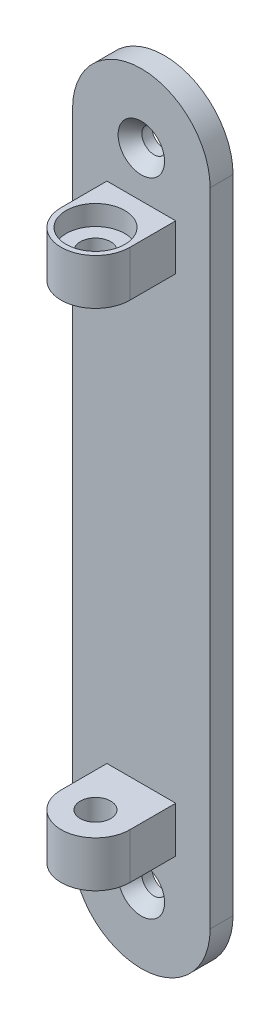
ISO-10303-21;
HEADER;
FILE_DESCRIPTION(('STEP AP214'),'2;1');
FILE_NAME('part.step','',(''),(''),'','','');
FILE_SCHEMA(('AUTOMOTIVE_DESIGN { 1 0 10303 214 1 1 1 1 }'));
ENDSEC;
DATA;
#1=APPLICATION_CONTEXT('core data for automotive mechanical design processes');
#2=APPLICATION_PROTOCOL_DEFINITION('international standard','automotive_design',2000,#1);
#3=PRODUCT_CONTEXT('',#1,'mechanical');
#4=PRODUCT('Part','Part','',(#3));
#5=PRODUCT_RELATED_PRODUCT_CATEGORY('part','',(#4));
#6=PRODUCT_DEFINITION_FORMATION('','',#4);
#7=PRODUCT_DEFINITION_CONTEXT('part definition',#1,'design');
#8=PRODUCT_DEFINITION('design','',#6,#7);
#9=PRODUCT_DEFINITION_SHAPE('','',#8);
#10=(LENGTH_UNIT() NAMED_UNIT(*) SI_UNIT(.MILLI.,.METRE.));
#11=(NAMED_UNIT(*) PLANE_ANGLE_UNIT() SI_UNIT($,.RADIAN.));
#12=(NAMED_UNIT(*) SI_UNIT($,.STERADIAN.) SOLID_ANGLE_UNIT());
#13=UNCERTAINTY_MEASURE_WITH_UNIT(LENGTH_MEASURE(1.E-05),#10,'distance_accuracy_value','');
#14=(GEOMETRIC_REPRESENTATION_CONTEXT(3) GLOBAL_UNCERTAINTY_ASSIGNED_CONTEXT((#13)) GLOBAL_UNIT_ASSIGNED_CONTEXT((#10,
#11,#12)) REPRESENTATION_CONTEXT('',''));
#15=CARTESIAN_POINT('',(0.,0.,0.));
#16=DIRECTION('',(0.,0.,1.));
#17=DIRECTION('',(1.,0.,0.));
#18=AXIS2_PLACEMENT_3D('',#15,#16,#17);
#19=CARTESIAN_POINT('',(9.52500000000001,63.5,19.05));
#20=DIRECTION('',(0.,1.,0.));
#21=DIRECTION('',(0.,0.,1.));
#22=AXIS2_PLACEMENT_3D('',#19,#20,#21);
#23=PLANE('',#22);
#24=DIRECTION('',(1.,0.,0.));
#25=VECTOR('',#24,1.);
#26=CARTESIAN_POINT('',(9.52500000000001,63.5,6.35));
#27=LINE('',#26,#25);
#28=CARTESIAN_POINT('',(9.525,63.5,6.35));
#29=VERTEX_POINT('',#28);
#30=CARTESIAN_POINT('',(28.575,63.5,6.35));
#31=VERTEX_POINT('',#30);
#32=EDGE_CURVE('E41',#29,#31,#27,.T.);
#33=ORIENTED_EDGE('',*,*,#32,.T.);
#34=DIRECTION('',(0.,0.,-1.));
#35=VECTOR('',#34,1.);
#36=CARTESIAN_POINT('',(28.575,63.5,19.05));
#37=LINE('',#36,#35);
#38=CARTESIAN_POINT('',(28.575,63.5,19.05));
#39=VERTEX_POINT('',#38);
#40=EDGE_CURVE('E217',#39,#31,#37,.T.);
#41=ORIENTED_EDGE('',*,*,#40,.F.);
#42=CARTESIAN_POINT('',(19.05,63.5,19.05));
#43=DIRECTION('',(0.,1.,0.));
#44=DIRECTION('',(0.,0.,1.));
#45=AXIS2_PLACEMENT_3D('',#42,#43,#44);
#46=CIRCLE('',#45,9.52499999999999);
#47=CARTESIAN_POINT('',(9.52500000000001,63.5,19.05));
#48=VERTEX_POINT('',#47);
#49=EDGE_CURVE('E192',#39,#48,#46,.F.);
#50=ORIENTED_EDGE('',*,*,#49,.T.);
#51=DIRECTION('',(0.,0.,-1.));
#52=VECTOR('',#51,1.);
#53=CARTESIAN_POINT('',(9.52500000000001,63.5,19.05));
#54=LINE('',#53,#52);
#55=EDGE_CURVE('E220',#48,#29,#54,.T.);
#56=ORIENTED_EDGE('',*,*,#55,.T.);
#57=EDGE_LOOP('',(#33,#41,#50,#56));
#58=FACE_BOUND('',#57,.T.);
#59=CARTESIAN_POINT('',(19.05,63.5,19.05));
#60=DIRECTION('',(0.,1.,0.));
#61=DIRECTION('',(0.,0.,1.));
#62=AXIS2_PLACEMENT_3D('',#59,#60,#61);
#63=CIRCLE('',#62,4.21639999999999);
#64=CARTESIAN_POINT('',(19.05,63.5,23.2664));
#65=VERTEX_POINT('',#64);
#66=EDGE_CURVE('E188',#65,#65,#63,.F.);
#67=ORIENTED_EDGE('',*,*,#66,.F.);
#68=EDGE_LOOP('',(#67));
#69=FACE_BOUND('',#68,.T.);
#70=ADVANCED_FACE('F26',(#58,#69),#23,.F.);
#71=CARTESIAN_POINT('',(19.05,88.9,6.35));
#72=DIRECTION('',(0.,0.,-1.));
#73=DIRECTION('',(-1.,0.,0.));
#74=AXIS2_PLACEMENT_3D('',#71,#72,#73);
#75=PLANE('',#74);
#76=DIRECTION('',(0.,-1.,0.));
#77=VECTOR('',#76,1.);
#78=CARTESIAN_POINT('',(0.,0.,6.35));
#79=LINE('',#78,#77);
#80=CARTESIAN_POINT('',(0.,88.9,6.35));
#81=VERTEX_POINT('',#80);
#82=CARTESIAN_POINT('',(0.,-88.9,6.35));
#83=VERTEX_POINT('',#82);
#84=EDGE_CURVE('E241',#81,#83,#79,.T.);
#85=ORIENTED_EDGE('',*,*,#84,.T.);
#86=CARTESIAN_POINT('',(19.05,-88.9,6.35));
#87=DIRECTION('',(0.,0.,-1.));
#88=DIRECTION('',(-1.,0.,0.));
#89=AXIS2_PLACEMENT_3D('',#86,#87,#88);
#90=CIRCLE('',#89,19.05);
#91=CARTESIAN_POINT('',(38.1,-88.9,6.35));
#92=VERTEX_POINT('',#91);
#93=EDGE_CURVE('E170',#92,#83,#90,.T.);
#94=ORIENTED_EDGE('',*,*,#93,.F.);
#95=DIRECTION('',(0.,1.,0.));
#96=VECTOR('',#95,1.);
#97=CARTESIAN_POINT('',(38.1,88.9,6.35));
#98=LINE('',#97,#96);
#99=CARTESIAN_POINT('',(38.1,88.9,6.35));
#100=VERTEX_POINT('',#99);
#101=EDGE_CURVE('E237',#92,#100,#98,.T.);
#102=ORIENTED_EDGE('',*,*,#101,.T.);
#103=CARTESIAN_POINT('',(19.05,88.9,6.35));
#104=DIRECTION('',(0.,0.,1.));
#105=DIRECTION('',(-1.,0.,0.));
#106=AXIS2_PLACEMENT_3D('',#103,#104,#105);
#107=CIRCLE('',#106,19.05);
#108=EDGE_CURVE('E239',#100,#81,#107,.T.);
#109=ORIENTED_EDGE('',*,*,#108,.T.);
#110=EDGE_LOOP('',(#85,#94,#102,#109));
#111=FACE_BOUND('',#110,.T.);
#112=CARTESIAN_POINT('',(19.05,88.9,6.35));
#113=DIRECTION('',(0.,0.,1.));
#114=DIRECTION('',(1.,0.,0.));
#115=AXIS2_PLACEMENT_3D('',#112,#113,#114);
#116=CIRCLE('',#115,6.4389);
#117=CARTESIAN_POINT('',(25.4889,88.9,6.35));
#118=VERTEX_POINT('',#117);
#119=EDGE_CURVE('E228',#118,#118,#116,.T.);
#120=ORIENTED_EDGE('',*,*,#119,.F.);
#121=EDGE_LOOP('',(#120));
#122=FACE_BOUND('',#121,.T.);
#123=DIRECTION('',(0.,-1.,0.));
#124=VECTOR('',#123,1.);
#125=CARTESIAN_POINT('',(9.52500000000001,76.2,6.35));
#126=LINE('',#125,#124);
#127=CARTESIAN_POINT('',(9.52500000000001,76.2,6.35));
#128=VERTEX_POINT('',#127);
#129=EDGE_CURVE('E195',#128,#29,#126,.T.);
#130=ORIENTED_EDGE('',*,*,#129,.F.);
#131=DIRECTION('',(-1.,0.,0.));
#132=VECTOR('',#131,1.);
#133=CARTESIAN_POINT('',(9.52500000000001,76.2,6.35));
#134=LINE('',#133,#132);
#135=CARTESIAN_POINT('',(28.575,76.2,6.35));
#136=VERTEX_POINT('',#135);
#137=EDGE_CURVE('E202',#136,#128,#134,.T.);
#138=ORIENTED_EDGE('',*,*,#137,.F.);
#139=DIRECTION('',(0.,1.,0.));
#140=VECTOR('',#139,1.);
#141=CARTESIAN_POINT('',(28.575,76.2,6.35));
#142=LINE('',#141,#140);
#143=EDGE_CURVE('E46',#31,#136,#142,.T.);
#144=ORIENTED_EDGE('',*,*,#143,.F.);
#145=ORIENTED_EDGE('',*,*,#32,.F.);
#146=EDGE_LOOP('',(#130,#138,#144,#145));
#147=FACE_BOUND('',#146,.T.);
#148=CARTESIAN_POINT('',(19.05,-88.9,6.35));
#149=DIRECTION('',(0.,0.,-1.));
#150=DIRECTION('',(1.,0.,0.));
#151=AXIS2_PLACEMENT_3D('',#148,#149,#150);
#152=CIRCLE('',#151,6.4389);
#153=CARTESIAN_POINT('',(25.4889,-88.9,6.35));
#154=VERTEX_POINT('',#153);
#155=EDGE_CURVE('E164',#154,#154,#152,.T.);
#156=ORIENTED_EDGE('',*,*,#155,.T.);
#157=EDGE_LOOP('',(#156));
#158=FACE_BOUND('',#157,.T.);
#159=DIRECTION('',(0.,1.,0.));
#160=VECTOR('',#159,1.);
#161=CARTESIAN_POINT('',(9.525,-76.2,6.35));
#162=LINE('',#161,#160);
#163=CARTESIAN_POINT('',(9.525,-76.2,6.35));
#164=VERTEX_POINT('',#163);
#165=CARTESIAN_POINT('',(9.525,-63.5,6.35));
#166=VERTEX_POINT('',#165);
#167=EDGE_CURVE('E140',#164,#166,#162,.T.);
#168=ORIENTED_EDGE('',*,*,#167,.T.);
#169=DIRECTION('',(1.,0.,0.));
#170=VECTOR('',#169,1.);
#171=CARTESIAN_POINT('',(9.525,-63.5,6.35));
#172=LINE('',#171,#170);
#173=CARTESIAN_POINT('',(28.575,-63.5,6.35));
#174=VERTEX_POINT('',#173);
#175=EDGE_CURVE('E142',#166,#174,#172,.T.);
#176=ORIENTED_EDGE('',*,*,#175,.T.);
#177=DIRECTION('',(0.,-1.,0.));
#178=VECTOR('',#177,1.);
#179=CARTESIAN_POINT('',(28.575,-76.2,6.35));
#180=LINE('',#179,#178);
#181=CARTESIAN_POINT('',(28.575,-76.2,6.35));
#182=VERTEX_POINT('',#181);
#183=EDGE_CURVE('E130',#174,#182,#180,.T.);
#184=ORIENTED_EDGE('',*,*,#183,.T.);
#185=DIRECTION('',(-1.,0.,0.));
#186=VECTOR('',#185,1.);
#187=CARTESIAN_POINT('',(9.525,-76.2,6.35));
#188=LINE('',#187,#186);
#189=EDGE_CURVE('E151',#182,#164,#188,.T.);
#190=ORIENTED_EDGE('',*,*,#189,.T.);
#191=EDGE_LOOP('',(#168,#176,#184,#190));
#192=FACE_BOUND('',#191,.T.);
#193=ADVANCED_FACE('F261',(#111,#122,#147,#158,#192),#75,.F.);
#194=CARTESIAN_POINT('',(19.05,88.9,0.));
#195=DIRECTION('',(0.,0.,-1.));
#196=DIRECTION('',(-1.,0.,0.));
#197=AXIS2_PLACEMENT_3D('',#194,#195,#196);
#198=PLANE('',#197);
#199=DIRECTION('',(0.,1.,0.));
#200=VECTOR('',#199,1.);
#201=CARTESIAN_POINT('',(38.1,88.9,0.));
#202=LINE('',#201,#200);
#203=CARTESIAN_POINT('',(38.1,-88.9,0.));
#204=VERTEX_POINT('',#203);
#205=CARTESIAN_POINT('',(38.1,88.9,0.));
#206=VERTEX_POINT('',#205);
#207=EDGE_CURVE('E231',#204,#206,#202,.T.);
#208=ORIENTED_EDGE('',*,*,#207,.F.);
#209=CARTESIAN_POINT('',(19.05,-88.9,0.));
#210=DIRECTION('',(0.,0.,-1.));
#211=DIRECTION('',(-1.,0.,0.));
#212=AXIS2_PLACEMENT_3D('',#209,#210,#211);
#213=CIRCLE('',#212,19.05);
#214=CARTESIAN_POINT('',(0.,-88.9,0.));
#215=VERTEX_POINT('',#214);
#216=EDGE_CURVE('E167',#204,#215,#213,.T.);
#217=ORIENTED_EDGE('',*,*,#216,.T.);
#218=DIRECTION('',(0.,-1.,0.));
#219=VECTOR('',#218,1.);
#220=CARTESIAN_POINT('',(0.,0.,0.));
#221=LINE('',#220,#219);
#222=CARTESIAN_POINT('',(0.,88.9,0.));
#223=VERTEX_POINT('',#222);
#224=EDGE_CURVE('E235',#223,#215,#221,.T.);
#225=ORIENTED_EDGE('',*,*,#224,.F.);
#226=CARTESIAN_POINT('',(19.05,88.9,0.));
#227=DIRECTION('',(0.,0.,1.));
#228=DIRECTION('',(-1.,0.,0.));
#229=AXIS2_PLACEMENT_3D('',#226,#227,#228);
#230=CIRCLE('',#229,19.05);
#231=EDGE_CURVE('E233',#206,#223,#230,.T.);
#232=ORIENTED_EDGE('',*,*,#231,.F.);
#233=EDGE_LOOP('',(#208,#217,#225,#232));
#234=FACE_BOUND('',#233,.T.);
#235=CARTESIAN_POINT('',(19.05,88.9,0.));
#236=DIRECTION('',(0.,0.,1.));
#237=DIRECTION('',(1.,0.,0.));
#238=AXIS2_PLACEMENT_3D('',#235,#236,#237);
#239=CIRCLE('',#238,3.3782);
#240=CARTESIAN_POINT('',(22.4282,88.9,0.));
#241=VERTEX_POINT('',#240);
#242=EDGE_CURVE('E222',#241,#241,#239,.T.);
#243=ORIENTED_EDGE('',*,*,#242,.T.);
#244=EDGE_LOOP('',(#243));
#245=FACE_BOUND('',#244,.T.);
#246=CARTESIAN_POINT('',(19.05,-88.9,0.));
#247=DIRECTION('',(0.,0.,-1.));
#248=DIRECTION('',(1.,0.,0.));
#249=AXIS2_PLACEMENT_3D('',#246,#247,#248);
#250=CIRCLE('',#249,3.3782);
#251=CARTESIAN_POINT('',(22.4282,-88.9,0.));
#252=VERTEX_POINT('',#251);
#253=EDGE_CURVE('E158',#252,#252,#250,.T.);
#254=ORIENTED_EDGE('',*,*,#253,.F.);
#255=EDGE_LOOP('',(#254));
#256=FACE_BOUND('',#255,.T.);
#257=ADVANCED_FACE('F253',(#234,#245,#256),#198,.T.);
#258=CARTESIAN_POINT('',(38.1,88.9,6.35));
#259=DIRECTION('',(-1.,0.,0.));
#260=DIRECTION('',(0.,0.,1.));
#261=AXIS2_PLACEMENT_3D('',#258,#259,#260);
#262=PLANE('',#261);
#263=ORIENTED_EDGE('',*,*,#207,.T.);
#264=DIRECTION('',(0.,0.,-1.));
#265=VECTOR('',#264,1.);
#266=CARTESIAN_POINT('',(38.1,88.9,6.35));
#267=LINE('',#266,#265);
#268=EDGE_CURVE('E11',#100,#206,#267,.T.);
#269=ORIENTED_EDGE('',*,*,#268,.F.);
#270=ORIENTED_EDGE('',*,*,#101,.F.);
#271=DIRECTION('',(0.,0.,-1.));
#272=VECTOR('',#271,1.);
#273=CARTESIAN_POINT('',(38.1,-88.9,6.35));
#274=LINE('',#273,#272);
#275=EDGE_CURVE('E176',#92,#204,#274,.T.);
#276=ORIENTED_EDGE('',*,*,#275,.T.);
#277=EDGE_LOOP('',(#263,#269,#270,#276));
#278=FACE_BOUND('',#277,.T.);
#279=ADVANCED_FACE('F28',(#278),#262,.F.);
#280=CARTESIAN_POINT('',(19.05,88.9,6.35));
#281=DIRECTION('',(0.,0.,-1.));
#282=DIRECTION('',(-1.,0.,0.));
#283=AXIS2_PLACEMENT_3D('',#280,#281,#282);
#284=CYLINDRICAL_SURFACE('',#283,19.05);
#285=ORIENTED_EDGE('',*,*,#231,.T.);
#286=DIRECTION('',(0.,0.,-1.));
#287=VECTOR('',#286,1.);
#288=CARTESIAN_POINT('',(0.,88.9,6.35));
#289=LINE('',#288,#287);
#290=EDGE_CURVE('E34',#81,#223,#289,.T.);
#291=ORIENTED_EDGE('',*,*,#290,.F.);
#292=ORIENTED_EDGE('',*,*,#108,.F.);
#293=ORIENTED_EDGE('',*,*,#268,.T.);
#294=EDGE_LOOP('',(#285,#291,#292,#293));
#295=FACE_BOUND('',#294,.T.);
#296=ADVANCED_FACE('F264',(#295),#284,.T.);
#297=CARTESIAN_POINT('',(0.,0.,6.35));
#298=DIRECTION('',(1.,0.,0.));
#299=DIRECTION('',(0.,0.,-1.));
#300=AXIS2_PLACEMENT_3D('',#297,#298,#299);
#301=PLANE('',#300);
#302=ORIENTED_EDGE('',*,*,#224,.T.);
#303=DIRECTION('',(0.,0.,-1.));
#304=VECTOR('',#303,1.);
#305=CARTESIAN_POINT('',(0.,-88.9,6.35));
#306=LINE('',#305,#304);
#307=EDGE_CURVE('E173',#83,#215,#306,.T.);
#308=ORIENTED_EDGE('',*,*,#307,.F.);
#309=ORIENTED_EDGE('',*,*,#84,.F.);
#310=ORIENTED_EDGE('',*,*,#290,.T.);
#311=EDGE_LOOP('',(#302,#308,#309,#310));
#312=FACE_BOUND('',#311,.T.);
#313=ADVANCED_FACE('F247',(#312),#301,.F.);
#314=CARTESIAN_POINT('',(19.05,88.9,6.35));
#315=DIRECTION('',(0.,0.,1.));
#316=DIRECTION('',(1.,0.,0.));
#317=AXIS2_PLACEMENT_3D('',#314,#315,#316);
#318=CONICAL_SURFACE('',#317,6.4389,0.715584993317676);
#319=CARTESIAN_POINT('',(19.05,88.9,2.82906741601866));
#320=DIRECTION('',(0.,0.,1.));
#321=DIRECTION('',(1.,0.,0.));
#322=AXIS2_PLACEMENT_3D('',#319,#320,#321);
#323=CIRCLE('',#322,3.3782);
#324=CARTESIAN_POINT('',(22.4282,88.9,2.82906741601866));
#325=VERTEX_POINT('',#324);
#326=EDGE_CURVE('E225',#325,#325,#323,.T.);
#327=ORIENTED_EDGE('',*,*,#326,.F.);
#328=EDGE_LOOP('',(#327));
#329=FACE_BOUND('',#328,.T.);
#330=ORIENTED_EDGE('',*,*,#119,.T.);
#331=EDGE_LOOP('',(#330));
#332=FACE_BOUND('',#331,.T.);
#333=ADVANCED_FACE('F294',(#329,#332),#318,.F.);
#334=CARTESIAN_POINT('',(19.05,88.9,6.35));
#335=DIRECTION('',(0.,0.,1.));
#336=DIRECTION('',(1.,0.,0.));
#337=AXIS2_PLACEMENT_3D('',#334,#335,#336);
#338=CYLINDRICAL_SURFACE('',#337,3.3782);
#339=ORIENTED_EDGE('',*,*,#242,.F.);
#340=EDGE_LOOP('',(#339));
#341=FACE_BOUND('',#340,.T.);
#342=ORIENTED_EDGE('',*,*,#326,.T.);
#343=EDGE_LOOP('',(#342));
#344=FACE_BOUND('',#343,.T.);
#345=ADVANCED_FACE('F290',(#341,#344),#338,.F.);
#346=CARTESIAN_POINT('',(9.52500000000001,76.2,19.05));
#347=DIRECTION('',(1.,0.,0.));
#348=DIRECTION('',(0.,0.,-1.));
#349=AXIS2_PLACEMENT_3D('',#346,#347,#348);
#350=PLANE('',#349);
#351=ORIENTED_EDGE('',*,*,#129,.T.);
#352=ORIENTED_EDGE('',*,*,#55,.F.);
#353=DIRECTION('',(0.,-1.,0.));
#354=VECTOR('',#353,1.);
#355=CARTESIAN_POINT('',(9.52500000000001,76.2,19.05));
#356=LINE('',#355,#354);
#357=CARTESIAN_POINT('',(9.52500000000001,76.2,19.05));
#358=VERTEX_POINT('',#357);
#359=EDGE_CURVE('E205',#358,#48,#356,.T.);
#360=ORIENTED_EDGE('',*,*,#359,.F.);
#361=DIRECTION('',(0.,0.,-1.));
#362=VECTOR('',#361,1.);
#363=CARTESIAN_POINT('',(9.52500000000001,76.2,19.05));
#364=LINE('',#363,#362);
#365=EDGE_CURVE('E211',#358,#128,#364,.T.);
#366=ORIENTED_EDGE('',*,*,#365,.T.);
#367=EDGE_LOOP('',(#351,#352,#360,#366));
#368=FACE_BOUND('',#367,.T.);
#369=ADVANCED_FACE('F287',(#368),#350,.F.);
#370=CARTESIAN_POINT('',(28.575,76.2,19.05));
#371=DIRECTION('',(-1.,0.,0.));
#372=DIRECTION('',(0.,0.,1.));
#373=AXIS2_PLACEMENT_3D('',#370,#371,#372);
#374=PLANE('',#373);
#375=ORIENTED_EDGE('',*,*,#143,.T.);
#376=DIRECTION('',(0.,0.,-1.));
#377=VECTOR('',#376,1.);
#378=CARTESIAN_POINT('',(28.575,76.2,19.05));
#379=LINE('',#378,#377);
#380=CARTESIAN_POINT('',(28.575,76.2,19.05));
#381=VERTEX_POINT('',#380);
#382=EDGE_CURVE('E214',#381,#136,#379,.T.);
#383=ORIENTED_EDGE('',*,*,#382,.F.);
#384=DIRECTION('',(0.,1.,0.));
#385=VECTOR('',#384,1.);
#386=CARTESIAN_POINT('',(28.575,76.2,19.05));
#387=LINE('',#386,#385);
#388=EDGE_CURVE('E208',#39,#381,#387,.T.);
#389=ORIENTED_EDGE('',*,*,#388,.F.);
#390=ORIENTED_EDGE('',*,*,#40,.T.);
#391=EDGE_LOOP('',(#375,#383,#389,#390));
#392=FACE_BOUND('',#391,.T.);
#393=ADVANCED_FACE('F285',(#392),#374,.F.);
#394=CARTESIAN_POINT('',(9.52500000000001,76.2,19.05));
#395=DIRECTION('',(0.,-1.,0.));
#396=DIRECTION('',(0.,0.,-1.));
#397=AXIS2_PLACEMENT_3D('',#394,#395,#396);
#398=PLANE('',#397);
#399=CARTESIAN_POINT('',(19.05,76.2,19.05));
#400=DIRECTION('',(0.,1.,0.));
#401=DIRECTION('',(0.,0.,1.));
#402=AXIS2_PLACEMENT_3D('',#399,#400,#401);
#403=CIRCLE('',#402,8.13561999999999);
#404=CARTESIAN_POINT('',(19.05,76.2,27.18562));
#405=VERTEX_POINT('',#404);
#406=EDGE_CURVE('E179',#405,#405,#403,.T.);
#407=ORIENTED_EDGE('',*,*,#406,.F.);
#408=EDGE_LOOP('',(#407));
#409=FACE_BOUND('',#408,.T.);
#410=ORIENTED_EDGE('',*,*,#137,.T.);
#411=ORIENTED_EDGE('',*,*,#365,.F.);
#412=CARTESIAN_POINT('',(19.05,76.2,19.05));
#413=DIRECTION('',(0.,1.,0.));
#414=DIRECTION('',(0.,0.,1.));
#415=AXIS2_PLACEMENT_3D('',#412,#413,#414);
#416=CIRCLE('',#415,9.52499999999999);
#417=EDGE_CURVE('E191',#358,#381,#416,.T.);
#418=ORIENTED_EDGE('',*,*,#417,.T.);
#419=ORIENTED_EDGE('',*,*,#382,.T.);
#420=EDGE_LOOP('',(#410,#411,#418,#419));
#421=FACE_BOUND('',#420,.T.);
#422=ADVANCED_FACE('F403',(#409,#421),#398,.F.);
#423=CARTESIAN_POINT('',(19.05,42.2014525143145,19.05));
#424=DIRECTION('',(0.,1.,0.));
#425=DIRECTION('',(0.,0.,1.));
#426=AXIS2_PLACEMENT_3D('',#423,#424,#425);
#427=CYLINDRICAL_SURFACE('',#426,9.52499999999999);
#428=ORIENTED_EDGE('',*,*,#49,.F.);
#429=ORIENTED_EDGE('',*,*,#388,.T.);
#430=ORIENTED_EDGE('',*,*,#417,.F.);
#431=ORIENTED_EDGE('',*,*,#359,.T.);
#432=EDGE_LOOP('',(#428,#429,#430,#431));
#433=FACE_BOUND('',#432,.T.);
#434=ADVANCED_FACE('F400',(#433),#427,.T.);
#435=CARTESIAN_POINT('',(19.05,76.2,19.05));
#436=DIRECTION('',(0.,1.,0.));
#437=DIRECTION('',(0.,0.,1.));
#438=AXIS2_PLACEMENT_3D('',#435,#436,#437);
#439=CYLINDRICAL_SURFACE('',#438,4.21639999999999);
#440=ORIENTED_EDGE('',*,*,#66,.T.);
#441=EDGE_LOOP('',(#440));
#442=FACE_BOUND('',#441,.T.);
#443=CARTESIAN_POINT('',(19.05,70.6628,19.05));
#444=DIRECTION('',(0.,1.,0.));
#445=DIRECTION('',(0.,0.,1.));
#446=AXIS2_PLACEMENT_3D('',#443,#444,#445);
#447=CIRCLE('',#446,4.21639999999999);
#448=CARTESIAN_POINT('',(19.05,70.6628,23.2664));
#449=VERTEX_POINT('',#448);
#450=EDGE_CURVE('E185',#449,#449,#447,.T.);
#451=ORIENTED_EDGE('',*,*,#450,.T.);
#452=EDGE_LOOP('',(#451));
#453=FACE_BOUND('',#452,.T.);
#454=ADVANCED_FACE('F396',(#442,#453),#439,.F.);
#455=CARTESIAN_POINT('',(23.2664,70.6628,19.05));
#456=DIRECTION('',(0.,-1.,0.));
#457=DIRECTION('',(0.,0.,-1.));
#458=AXIS2_PLACEMENT_3D('',#455,#456,#457);
#459=PLANE('',#458);
#460=ORIENTED_EDGE('',*,*,#450,.F.);
#461=EDGE_LOOP('',(#460));
#462=FACE_BOUND('',#461,.T.);
#463=CARTESIAN_POINT('',(19.05,70.6628,19.05));
#464=DIRECTION('',(0.,1.,0.));
#465=DIRECTION('',(0.,0.,1.));
#466=AXIS2_PLACEMENT_3D('',#463,#464,#465);
#467=CIRCLE('',#466,8.13562);
#468=CARTESIAN_POINT('',(19.05,70.6628,27.18562));
#469=VERTEX_POINT('',#468);
#470=EDGE_CURVE('E182',#469,#469,#467,.T.);
#471=ORIENTED_EDGE('',*,*,#470,.T.);
#472=EDGE_LOOP('',(#471));
#473=FACE_BOUND('',#472,.T.);
#474=ADVANCED_FACE('F392',(#462,#473),#459,.F.);
#475=CARTESIAN_POINT('',(19.05,76.2,19.05));
#476=DIRECTION('',(0.,1.,0.));
#477=DIRECTION('',(0.,0.,1.));
#478=AXIS2_PLACEMENT_3D('',#475,#476,#477);
#479=CYLINDRICAL_SURFACE('',#478,8.13561999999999);
#480=ORIENTED_EDGE('',*,*,#470,.F.);
#481=EDGE_LOOP('',(#480));
#482=FACE_BOUND('',#481,.T.);
#483=ORIENTED_EDGE('',*,*,#406,.T.);
#484=EDGE_LOOP('',(#483));
#485=FACE_BOUND('',#484,.T.);
#486=ADVANCED_FACE('F309',(#482,#485),#479,.F.);
#487=CARTESIAN_POINT('',(9.525,-63.5,19.05));
#488=DIRECTION('',(0.,-1.,0.));
#489=DIRECTION('',(0.,0.,1.));
#490=AXIS2_PLACEMENT_3D('',#487,#488,#489);
#491=PLANE('',#490);
#492=ORIENTED_EDGE('',*,*,#175,.F.);
#493=DIRECTION('',(0.,0.,-1.));
#494=VECTOR('',#493,1.);
#495=CARTESIAN_POINT('',(9.525,-63.5,19.05));
#496=LINE('',#495,#494);
#497=CARTESIAN_POINT('',(9.525,-63.5,19.05));
#498=VERTEX_POINT('',#497);
#499=EDGE_CURVE('E134',#498,#166,#496,.T.);
#500=ORIENTED_EDGE('',*,*,#499,.F.);
#501=CARTESIAN_POINT('',(19.05,-63.5,19.05));
#502=DIRECTION('',(0.,1.,0.));
#503=DIRECTION('',(0.,0.,1.));
#504=AXIS2_PLACEMENT_3D('',#501,#502,#503);
#505=CIRCLE('',#504,9.52499999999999);
#506=CARTESIAN_POINT('',(28.575,-63.5,19.05));
#507=VERTEX_POINT('',#506);
#508=EDGE_CURVE('E118',#507,#498,#505,.F.);
#509=ORIENTED_EDGE('',*,*,#508,.F.);
#510=DIRECTION('',(0.,0.,-1.));
#511=VECTOR('',#510,1.);
#512=CARTESIAN_POINT('',(28.575,-63.5,19.05));
#513=LINE('',#512,#511);
#514=EDGE_CURVE('E127',#507,#174,#513,.T.);
#515=ORIENTED_EDGE('',*,*,#514,.T.);
#516=EDGE_LOOP('',(#492,#500,#509,#515));
#517=FACE_BOUND('',#516,.T.);
#518=CARTESIAN_POINT('',(19.05,-63.5,19.05));
#519=DIRECTION('',(0.,1.,0.));
#520=DIRECTION('',(0.,0.,1.));
#521=AXIS2_PLACEMENT_3D('',#518,#519,#520);
#522=CIRCLE('',#521,4.21639999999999);
#523=CARTESIAN_POINT('',(19.05,-63.5,23.2664));
#524=VERTEX_POINT('',#523);
#525=EDGE_CURVE('E144',#524,#524,#522,.F.);
#526=ORIENTED_EDGE('',*,*,#525,.T.);
#527=EDGE_LOOP('',(#526));
#528=FACE_BOUND('',#527,.T.);
#529=ADVANCED_FACE('F137',(#517,#528),#491,.F.);
#530=CARTESIAN_POINT('',(19.05,-88.9,6.35));
#531=DIRECTION('',(0.,0.,-1.));
#532=DIRECTION('',(-1.,0.,0.));
#533=AXIS2_PLACEMENT_3D('',#530,#531,#532);
#534=CYLINDRICAL_SURFACE('',#533,19.05);
#535=ORIENTED_EDGE('',*,*,#216,.F.);
#536=ORIENTED_EDGE('',*,*,#275,.F.);
#537=ORIENTED_EDGE('',*,*,#93,.T.);
#538=ORIENTED_EDGE('',*,*,#307,.T.);
#539=EDGE_LOOP('',(#535,#536,#537,#538));
#540=FACE_BOUND('',#539,.T.);
#541=ADVANCED_FACE('F258',(#540),#534,.T.);
#542=CARTESIAN_POINT('',(19.05,-88.9,6.35));
#543=DIRECTION('',(0.,0.,1.));
#544=DIRECTION('',(1.,0.,0.));
#545=AXIS2_PLACEMENT_3D('',#542,#543,#544);
#546=CONICAL_SURFACE('',#545,6.4389,0.715584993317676);
#547=CARTESIAN_POINT('',(19.05,-88.9,2.82906741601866));
#548=DIRECTION('',(0.,0.,-1.));
#549=DIRECTION('',(1.,0.,0.));
#550=AXIS2_PLACEMENT_3D('',#547,#548,#549);
#551=CIRCLE('',#550,3.3782);
#552=CARTESIAN_POINT('',(22.4282,-88.9,2.82906741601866));
#553=VERTEX_POINT('',#552);
#554=EDGE_CURVE('E161',#553,#553,#551,.T.);
#555=ORIENTED_EDGE('',*,*,#554,.T.);
#556=EDGE_LOOP('',(#555));
#557=FACE_BOUND('',#556,.T.);
#558=ORIENTED_EDGE('',*,*,#155,.F.);
#559=EDGE_LOOP('',(#558));
#560=FACE_BOUND('',#559,.T.);
#561=ADVANCED_FACE('F316',(#557,#560),#546,.F.);
#562=CARTESIAN_POINT('',(19.05,-88.9,6.35));
#563=DIRECTION('',(0.,0.,1.));
#564=DIRECTION('',(1.,0.,0.));
#565=AXIS2_PLACEMENT_3D('',#562,#563,#564);
#566=CYLINDRICAL_SURFACE('',#565,3.3782);
#567=ORIENTED_EDGE('',*,*,#253,.T.);
#568=EDGE_LOOP('',(#567));
#569=FACE_BOUND('',#568,.T.);
#570=ORIENTED_EDGE('',*,*,#554,.F.);
#571=EDGE_LOOP('',(#570));
#572=FACE_BOUND('',#571,.T.);
#573=ADVANCED_FACE('F323',(#569,#572),#566,.F.);
#574=CARTESIAN_POINT('',(9.525,-76.2,19.05));
#575=DIRECTION('',(1.,0.,0.));
#576=DIRECTION('',(0.,0.,-1.));
#577=AXIS2_PLACEMENT_3D('',#574,#575,#576);
#578=PLANE('',#577);
#579=ORIENTED_EDGE('',*,*,#167,.F.);
#580=DIRECTION('',(0.,0.,-1.));
#581=VECTOR('',#580,1.);
#582=CARTESIAN_POINT('',(9.525,-76.2,19.05));
#583=LINE('',#582,#581);
#584=CARTESIAN_POINT('',(9.525,-76.2,19.05));
#585=VERTEX_POINT('',#584);
#586=EDGE_CURVE('E123',#585,#164,#583,.T.);
#587=ORIENTED_EDGE('',*,*,#586,.F.);
#588=DIRECTION('',(0.,1.,0.));
#589=VECTOR('',#588,1.);
#590=CARTESIAN_POINT('',(9.525,-76.2,19.05));
#591=LINE('',#590,#589);
#592=EDGE_CURVE('E124',#585,#498,#591,.T.);
#593=ORIENTED_EDGE('',*,*,#592,.T.);
#594=ORIENTED_EDGE('',*,*,#499,.T.);
#595=EDGE_LOOP('',(#579,#587,#593,#594));
#596=FACE_BOUND('',#595,.T.);
#597=ADVANCED_FACE('F331',(#596),#578,.F.);
#598=CARTESIAN_POINT('',(28.575,-76.2,19.05));
#599=DIRECTION('',(-1.,0.,0.));
#600=DIRECTION('',(0.,0.,1.));
#601=AXIS2_PLACEMENT_3D('',#598,#599,#600);
#602=PLANE('',#601);
#603=ORIENTED_EDGE('',*,*,#183,.F.);
#604=ORIENTED_EDGE('',*,*,#514,.F.);
#605=DIRECTION('',(0.,-1.,0.));
#606=VECTOR('',#605,1.);
#607=CARTESIAN_POINT('',(28.575,-76.2,19.05));
#608=LINE('',#607,#606);
#609=CARTESIAN_POINT('',(28.575,-76.2,19.05));
#610=VERTEX_POINT('',#609);
#611=EDGE_CURVE('E113',#507,#610,#608,.T.);
#612=ORIENTED_EDGE('',*,*,#611,.T.);
#613=DIRECTION('',(0.,0.,-1.));
#614=VECTOR('',#613,1.);
#615=CARTESIAN_POINT('',(28.575,-76.2,19.05));
#616=LINE('',#615,#614);
#617=EDGE_CURVE('E135',#610,#182,#616,.T.);
#618=ORIENTED_EDGE('',*,*,#617,.T.);
#619=EDGE_LOOP('',(#603,#604,#612,#618));
#620=FACE_BOUND('',#619,.T.);
#621=ADVANCED_FACE('F128',(#620),#602,.F.);
#622=CARTESIAN_POINT('',(9.525,-76.2,19.05));
#623=DIRECTION('',(0.,1.,0.));
#624=DIRECTION('',(0.,0.,-1.));
#625=AXIS2_PLACEMENT_3D('',#622,#623,#624);
#626=PLANE('',#625);
#627=CARTESIAN_POINT('',(19.05,-76.2,19.05));
#628=DIRECTION('',(0.,1.,0.));
#629=DIRECTION('',(0.,0.,1.));
#630=AXIS2_PLACEMENT_3D('',#627,#628,#629);
#631=CIRCLE('',#630,8.13561999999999);
#632=CARTESIAN_POINT('',(19.05,-76.2,27.18562));
#633=VERTEX_POINT('',#632);
#634=EDGE_CURVE('E500',#633,#633,#631,.T.);
#635=ORIENTED_EDGE('',*,*,#634,.T.);
#636=EDGE_LOOP('',(#635));
#637=FACE_BOUND('',#636,.T.);
#638=ORIENTED_EDGE('',*,*,#189,.F.);
#639=ORIENTED_EDGE('',*,*,#617,.F.);
#640=CARTESIAN_POINT('',(19.05,-76.2,19.05));
#641=DIRECTION('',(0.,1.,0.));
#642=DIRECTION('',(0.,0.,1.));
#643=AXIS2_PLACEMENT_3D('',#640,#641,#642);
#644=CIRCLE('',#643,9.52499999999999);
#645=EDGE_CURVE('E120',#585,#610,#644,.T.);
#646=ORIENTED_EDGE('',*,*,#645,.F.);
#647=ORIENTED_EDGE('',*,*,#586,.T.);
#648=EDGE_LOOP('',(#638,#639,#646,#647));
#649=FACE_BOUND('',#648,.T.);
#650=ADVANCED_FACE('F346',(#637,#649),#626,.F.);
#651=CARTESIAN_POINT('',(19.05,-42.2014525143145,19.05));
#652=DIRECTION('',(0.,-1.,0.));
#653=DIRECTION('',(0.,0.,1.));
#654=AXIS2_PLACEMENT_3D('',#651,#652,#653);
#655=CYLINDRICAL_SURFACE('',#654,9.52499999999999);
#656=ORIENTED_EDGE('',*,*,#508,.T.);
#657=ORIENTED_EDGE('',*,*,#592,.F.);
#658=ORIENTED_EDGE('',*,*,#645,.T.);
#659=ORIENTED_EDGE('',*,*,#611,.F.);
#660=EDGE_LOOP('',(#656,#657,#658,#659));
#661=FACE_BOUND('',#660,.T.);
#662=ADVANCED_FACE('F115',(#661),#655,.T.);
#663=CARTESIAN_POINT('',(19.05,-76.2,19.05));
#664=DIRECTION('',(0.,-1.,0.));
#665=DIRECTION('',(0.,0.,1.));
#666=AXIS2_PLACEMENT_3D('',#663,#664,#665);
#667=CYLINDRICAL_SURFACE('',#666,4.21639999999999);
#668=ORIENTED_EDGE('',*,*,#525,.F.);
#669=EDGE_LOOP('',(#668));
#670=FACE_BOUND('',#669,.T.);
#671=CARTESIAN_POINT('',(19.05,-70.6628,19.05));
#672=DIRECTION('',(0.,1.,0.));
#673=DIRECTION('',(0.,0.,1.));
#674=AXIS2_PLACEMENT_3D('',#671,#672,#673);
#675=CIRCLE('',#674,4.21639999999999);
#676=CARTESIAN_POINT('',(19.05,-70.6628,23.2664));
#677=VERTEX_POINT('',#676);
#678=EDGE_CURVE('E502',#677,#677,#675,.T.);
#679=ORIENTED_EDGE('',*,*,#678,.F.);
#680=EDGE_LOOP('',(#679));
#681=FACE_BOUND('',#680,.T.);
#682=ADVANCED_FACE('F361',(#670,#681),#667,.F.);
#683=CARTESIAN_POINT('',(23.2664,-70.6628,19.05));
#684=DIRECTION('',(0.,1.,0.));
#685=DIRECTION('',(0.,0.,-1.));
#686=AXIS2_PLACEMENT_3D('',#683,#684,#685);
#687=PLANE('',#686);
#688=ORIENTED_EDGE('',*,*,#678,.T.);
#689=EDGE_LOOP('',(#688));
#690=FACE_BOUND('',#689,.T.);
#691=CARTESIAN_POINT('',(19.05,-70.6628,19.05));
#692=DIRECTION('',(0.,1.,0.));
#693=DIRECTION('',(0.,0.,1.));
#694=AXIS2_PLACEMENT_3D('',#691,#692,#693);
#695=CIRCLE('',#694,8.13562);
#696=CARTESIAN_POINT('',(19.05,-70.6628,27.18562));
#697=VERTEX_POINT('',#696);
#698=EDGE_CURVE('E497',#697,#697,#695,.T.);
#699=ORIENTED_EDGE('',*,*,#698,.F.);
#700=EDGE_LOOP('',(#699));
#701=FACE_BOUND('',#700,.T.);
#702=ADVANCED_FACE('F368',(#690,#701),#687,.F.);
#703=CARTESIAN_POINT('',(19.05,-76.2,19.05));
#704=DIRECTION('',(0.,-1.,0.));
#705=DIRECTION('',(0.,0.,1.));
#706=AXIS2_PLACEMENT_3D('',#703,#704,#705);
#707=CYLINDRICAL_SURFACE('',#706,8.13561999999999);
#708=ORIENTED_EDGE('',*,*,#698,.T.);
#709=EDGE_LOOP('',(#708));
#710=FACE_BOUND('',#709,.T.);
#711=ORIENTED_EDGE('',*,*,#634,.F.);
#712=EDGE_LOOP('',(#711));
#713=FACE_BOUND('',#712,.T.);
#714=ADVANCED_FACE('F376',(#710,#713),#707,.F.);
#715=CLOSED_SHELL('',(#70,#193,#257,#279,#296,#313,#333,#345,#369,#393,#422,#434,#454,#474,#486,
#529,#541,#561,#573,#597,#621,#650,#662,#682,#702,#714));
#716=MANIFOLD_SOLID_BREP('B2',#715);
#717=ADVANCED_BREP_SHAPE_REPRESENTATION('',(#18,#716),#14);
#718=SHAPE_DEFINITION_REPRESENTATION(#9,#717);
ENDSEC;
END-ISO-10303-21;
